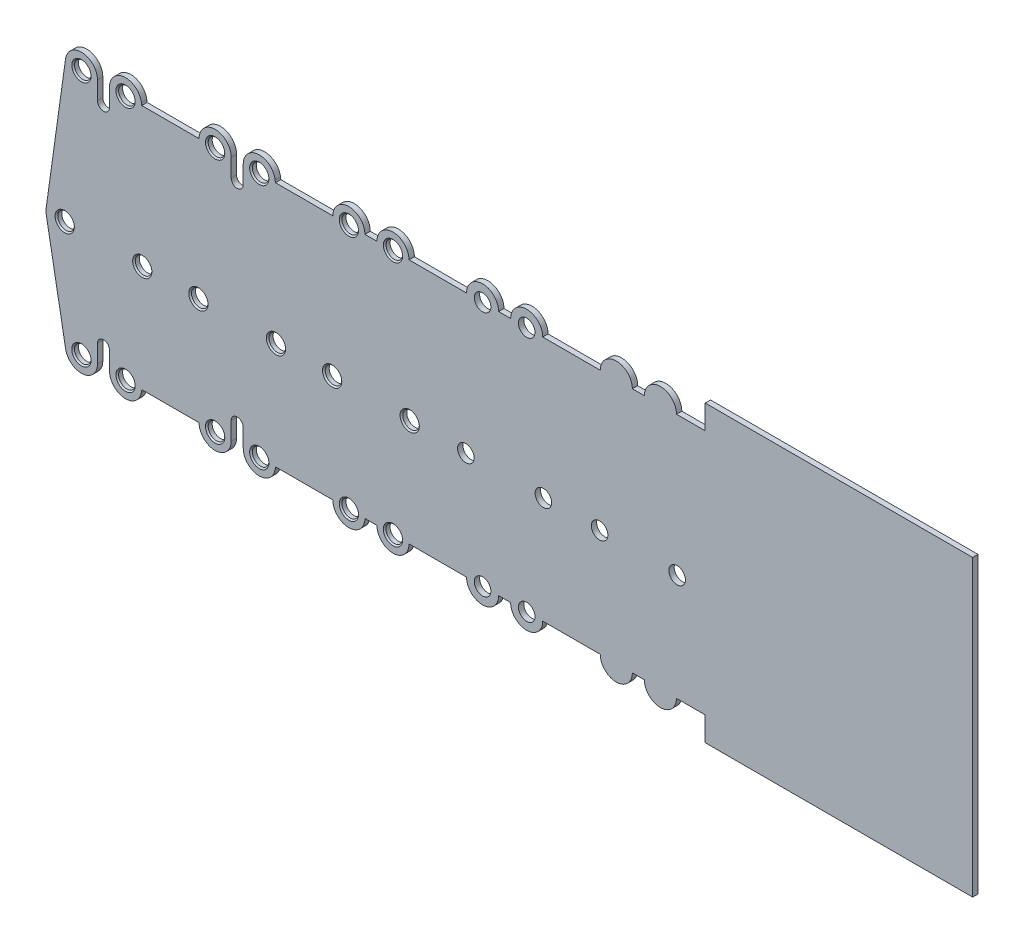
from build123d import *

# Parameters (mm, degrees)
ESQUISSE1_R                             = 3.1
BASE_EXTRUSION_DEPTH                    = 2
CHANFREIN1_SIZE                         = 0.5
BOSS_EXTRU_2_START                      = -2
BOSS_EXTRU_2_DEPTH                      = 2
R_P_TITION_LIN_AIRE3_COUNT              = 2
R_P_TITION_LIN_AIRE3_PITCH              = 50
CHANFREIN1_OF_R_P_TITION_LIN_AIRE3_SIZE = 0.5
ESQUISSE4_W                             = 2
ESQUISSE4_H                             = 92
BOSS_EXTRU_3_DEPTH                      = 250
BOSS_EXTRU_5_DEPTH                      = 2
ESQUISSE6_R                             = 3.1
ENL_V_MAT_EXTRU_1_DEPTH                 = 331.14087902
R_P_TITION_LIN_AIRE4_COUNT              = 3
R_P_TITION_LIN_AIRE4_PITCH              = 50
CHANFREIN2_SIZE                         = 0.5
R_P_TITION_LIN_AIRE5_COUNT              = 2
R_P_TITION_LIN_AIRE5_PITCH              = 50
ESQUISSE7_R                             = 3.1
ENL_V_MAT_EXTRU_2_DEPTH                 = 331.14087902
ESQUISSE8_W                             = 100
ESQUISSE8_H                             = 110
BOSS_EXTRU_6_DEPTH                      = 2


with BuildPart() as part:
    # Esquisse1 → Base-Extrusion (new body)
    with BuildSketch(Plane.XY):
        with BuildLine():
            Line((2.25, 45.25), (2.25, 52))
            ThreePointArc((2.25, 52), (7.834194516, 57.985574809), (14.1923686, 52.829611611))
            Line((14.1923686, 52.829611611), (21.432763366, 0.967880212))
            ThreePointArc((21.432763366, 0.967880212), (21.498530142, -0.143442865), (21.387282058, -1.251137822))
            Line((21.387282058, -1.251137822), (14.153384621, -41.072403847))
            ThreePointArc((14.153384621, -41.072403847), (7.711626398, -45.975797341), (2.25, -40))
            Line((2.25, -40), (2.25, -33.25))
            ThreePointArc((2.25, -33.25), (0, -31), (-2.25, -33.25))
            Line((-2.25, -33.25), (-2.25, -40))
            ThreePointArc((-2.25, -40), (-7.711626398, -45.975797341), (-14.153384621, -41.072403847))
            Line((-14.153384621, -41.072403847), (-21.387282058, -1.251137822))
            ThreePointArc((-21.387282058, -1.251137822), (-21.498530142, -0.143442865), (-21.432763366, 0.967880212))
            Line((-21.432763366, 0.967880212), (-14.1923686, 52.829611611))
            ThreePointArc((-14.1923686, 52.829611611), (-7.834194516, 57.985574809), (-2.25, 52))
            Line((-2.25, 52), (-2.25, 45.25))
            ThreePointArc((-2.25, 45.25), (0, 43), (2.25, 45.25))
        make_face()
        with Locations((-8.25, 52)):
            Circle(ESQUISSE1_R, mode=Mode.SUBTRACT)
        with Locations((8.25, 52)):
            Circle(ESQUISSE1_R, mode=Mode.SUBTRACT)
        with Locations((-14.5, 0)):
            Circle(ESQUISSE1_R, mode=Mode.SUBTRACT)
        with Locations((14.5, 0)):
            Circle(ESQUISSE1_R, mode=Mode.SUBTRACT)
        with Locations((-8.25, -40)):
            Circle(ESQUISSE1_R, mode=Mode.SUBTRACT)
        with Locations((8.25, -40)):
            Circle(ESQUISSE1_R, mode=Mode.SUBTRACT)
    base_extrusion = extrude(amount=BASE_EXTRUSION_DEPTH)

    # Chanfrein1
    chanfrein1_edges = [part.edges().sort_by_distance(p)[0] for p in [
        (-11.35, 52, 2),
        (5.15, 52, 2),
        (-17.6, 0, 2),
        (11.4, 0, 2),
        (-11.35, -40, 2),
        (5.15, -40, 2),
    ]]
    chamfer(chanfrein1_edges, length=CHANFREIN1_SIZE)

    # Esquisse3 → Boss.-Extru.2 (add)
    with BuildSketch(Plane.XY.offset(2).offset(BOSS_EXTRU_2_START)):
        with BuildLine():
            Line((21.432763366, 0.967880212), (14.308190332, 52))
            Line((14.308190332, 52), (25, 52))
            Line((25, 52), (25, -40))
            Line((25, -40), (14.348196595, -40))
            Line((14.348196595, -40), (21.387282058, -1.251137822))
            ThreePointArc((21.387282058, -1.251137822), (21.498530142, -0.143442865), (21.432763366, 0.967880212))
        make_face()
    boss_extru_2 = extrude(amount=BOSS_EXTRU_2_DEPTH)

    # Sym_trie1: Boss.-Extru.2 across plane
    add(boss_extru_2.mirror(Plane(origin=(25, 52, 0), x_dir=(0, 0, 1), z_dir=(1, 0, 0))))

    # R_p_tition lin_aire3: Base-Extrusion, Boss.-Extru.2 ×2
    with Locations(*[(i * R_P_TITION_LIN_AIRE3_PITCH, 0, 0) for i in range(1, R_P_TITION_LIN_AIRE3_COUNT)]):
        add(base_extrusion)
        add(boss_extru_2)

    # Chanfrein1 of R_p_tition lin_aire3
    chanfrein1_of_r_p_tition_lin_aire3_edges = [part.edges().sort_by_distance(p)[0] for p in [
        (38.65, 52, 2),
        (55.15, 52, 2),
        (32.4, 0, 2),
        (61.4, 0, 2),
        (38.65, -40, 2),
        (55.15, -40, 2),
    ]]
    chamfer(chanfrein1_of_r_p_tition_lin_aire3_edges, length=CHANFREIN1_OF_R_P_TITION_LIN_AIRE3_SIZE)

    # Esquisse4 → Boss.-Extru.3 (add)
    with BuildSketch(Plane(origin=(75, 0, 0), x_dir=(0, 0, -1), z_dir=(1, 0, 0))):
        with Locations((-1, 6)):
            Rectangle(ESQUISSE4_W, ESQUISSE4_H)
    extrude(amount=BOSS_EXTRU_3_DEPTH)

    # Esquisse5 → Boss.-Extru.5 (add)
    with BuildSketch(Plane.XY.offset(2)):
        with BuildLine():
            Line((85.75, 52), (97.75, 52))
            ThreePointArc((97.75, 52), (91.75, 58), (85.75, 52))
        make_face()
        with BuildLine():
            Line((102.25, 52), (114.25, 52))
            ThreePointArc((114.25, 52), (108.25, 58), (102.25, 52))
        make_face()
        with BuildLine():
            Line((85.75, -40), (97.75, -40))
            ThreePointArc((97.75, -40), (91.75, -46), (85.75, -40))
        make_face()
        with BuildLine():
            Line((102.25, -40), (114.25, -40))
            ThreePointArc((114.25, -40), (108.25, -46), (102.25, -40))
        make_face()
    boss_extru_5 = extrude(amount=-BOSS_EXTRU_5_DEPTH)

    # Esquisse6 → Enl_v. mat.-Extru.1 (cut, through all)
    with BuildSketch(Plane.XY.offset(2)):
        with Locations((108.25, 52)):
            Circle(ESQUISSE6_R)
        with Locations((91.75, 52)):
            Circle(ESQUISSE6_R)
        with Locations((91.75, -40)):
            Circle(ESQUISSE6_R)
        with Locations((108.25, -40)):
            Circle(ESQUISSE6_R)
        with Locations((85.5, 0)):
            Circle(ESQUISSE6_R)
        with Locations((114.5, 0)):
            Circle(ESQUISSE6_R)
    enl_v_mat_extru_1 = extrude(amount=-ENL_V_MAT_EXTRU_1_DEPTH, mode=Mode.SUBTRACT)

    # R_p_tition lin_aire4: Boss.-Extru.5 ×3
    with Locations(*[(i * R_P_TITION_LIN_AIRE4_PITCH, 0, 0) for i in range(1, R_P_TITION_LIN_AIRE4_COUNT)]):
        add(boss_extru_5)

    # Chanfrein2
    chanfrein2_edges = [part.edges().sort_by_distance(p)[0] for p in [
        (105.15, 52, 2),
        (88.65, 52, 2),
        (88.65, -40, 2),
        (105.15, -40, 2),
        (82.4, 0, 2),
        (111.4, 0, 2),
    ]]
    chamfer(chanfrein2_edges, length=CHANFREIN2_SIZE)

    # R_p_tition lin_aire5: Enl_v. mat.-Extru.1 ×2
    with Locations(*[(i * R_P_TITION_LIN_AIRE5_PITCH, 0, 0) for i in range(1, R_P_TITION_LIN_AIRE5_COUNT)]):
        add(enl_v_mat_extru_1, mode=Mode.SUBTRACT)

    # Esquisse7 → Enl_v. mat.-Extru.2 (cut, through all)
    with BuildSketch(Plane.XY.offset(2)):
        with Locations((185.5, 0)):
            Circle(ESQUISSE7_R)
        with Locations((214.5, 0)):
            Circle(ESQUISSE7_R)
    extrude(amount=-ENL_V_MAT_EXTRU_2_DEPTH, mode=Mode.SUBTRACT)

    # Esquisse8 → Boss.-Extru.6 (add)
    with BuildSketch(Plane.XY.offset(2)):
        with Locations((275, 6)):
            Rectangle(ESQUISSE8_W, ESQUISSE8_H)
    extrude(amount=-BOSS_EXTRU_6_DEPTH)


solid = part.part
